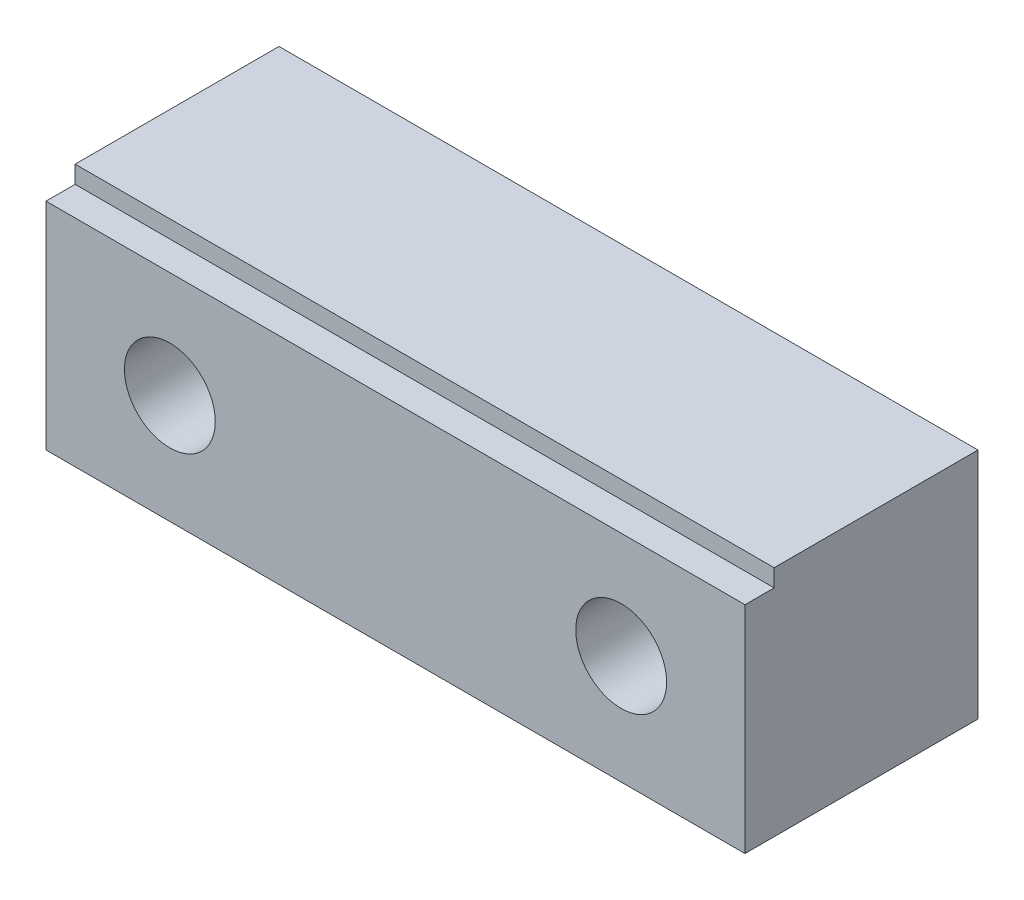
ISO-10303-21;
HEADER;
FILE_DESCRIPTION(('STEP AP214'),'2;1');
FILE_NAME('part.step','',(''),(''),'','','');
FILE_SCHEMA(('AUTOMOTIVE_DESIGN { 1 0 10303 214 1 1 1 1 }'));
ENDSEC;
DATA;
#1=APPLICATION_CONTEXT('core data for automotive mechanical design processes');
#2=APPLICATION_PROTOCOL_DEFINITION('international standard','automotive_design',2000,#1);
#3=PRODUCT_CONTEXT('',#1,'mechanical');
#4=PRODUCT('Part','Part','',(#3));
#5=PRODUCT_RELATED_PRODUCT_CATEGORY('part','',(#4));
#6=PRODUCT_DEFINITION_FORMATION('','',#4);
#7=PRODUCT_DEFINITION_CONTEXT('part definition',#1,'design');
#8=PRODUCT_DEFINITION('design','',#6,#7);
#9=PRODUCT_DEFINITION_SHAPE('','',#8);
#10=(LENGTH_UNIT() NAMED_UNIT(*) SI_UNIT(.MILLI.,.METRE.));
#11=(NAMED_UNIT(*) PLANE_ANGLE_UNIT() SI_UNIT($,.RADIAN.));
#12=(NAMED_UNIT(*) SI_UNIT($,.STERADIAN.) SOLID_ANGLE_UNIT());
#13=UNCERTAINTY_MEASURE_WITH_UNIT(LENGTH_MEASURE(1.E-05),#10,'distance_accuracy_value','');
#14=(GEOMETRIC_REPRESENTATION_CONTEXT(3) GLOBAL_UNCERTAINTY_ASSIGNED_CONTEXT((#13)) GLOBAL_UNIT_ASSIGNED_CONTEXT((#10,
#11,#12)) REPRESENTATION_CONTEXT('',''));
#15=CARTESIAN_POINT('',(0.,0.,0.));
#16=DIRECTION('',(0.,0.,1.));
#17=DIRECTION('',(1.,0.,0.));
#18=AXIS2_PLACEMENT_3D('',#15,#16,#17);
#19=CARTESIAN_POINT('',(76.2,-50.8,-25.4));
#20=DIRECTION('',(1.,0.,0.));
#21=DIRECTION('',(0.,0.,-1.));
#22=AXIS2_PLACEMENT_3D('',#19,#20,#21);
#23=PLANE('',#22);
#24=DIRECTION('',(0.,0.,1.));
#25=VECTOR('',#24,1.);
#26=CARTESIAN_POINT('',(76.2,-3.81,25.3999999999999));
#27=LINE('',#26,#25);
#28=CARTESIAN_POINT('',(76.2,-3.81,19.0499999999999));
#29=VERTEX_POINT('',#28);
#30=CARTESIAN_POINT('',(76.2,-3.81,25.3999999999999));
#31=VERTEX_POINT('',#30);
#32=EDGE_CURVE('E110',#29,#31,#27,.T.);
#33=ORIENTED_EDGE('',*,*,#32,.T.);
#34=DIRECTION('',(0.,1.,0.));
#35=VECTOR('',#34,1.);
#36=CARTESIAN_POINT('',(76.2,-50.8,25.4));
#37=LINE('',#36,#35);
#38=CARTESIAN_POINT('',(76.2,-50.8,25.4));
#39=VERTEX_POINT('',#38);
#40=EDGE_CURVE('E12',#39,#31,#37,.T.);
#41=ORIENTED_EDGE('',*,*,#40,.F.);
#42=DIRECTION('',(0.,0.,-1.));
#43=VECTOR('',#42,1.);
#44=CARTESIAN_POINT('',(76.2,-50.8,-25.4));
#45=LINE('',#44,#43);
#46=CARTESIAN_POINT('',(76.2,-50.8,-25.4));
#47=VERTEX_POINT('',#46);
#48=EDGE_CURVE('E142',#39,#47,#45,.T.);
#49=ORIENTED_EDGE('',*,*,#48,.T.);
#50=DIRECTION('',(0.,1.,0.));
#51=VECTOR('',#50,1.);
#52=CARTESIAN_POINT('',(76.2,-50.8,-25.4));
#53=LINE('',#52,#51);
#54=CARTESIAN_POINT('',(76.2,0.,-25.4));
#55=VERTEX_POINT('',#54);
#56=EDGE_CURVE('E85',#47,#55,#53,.T.);
#57=ORIENTED_EDGE('',*,*,#56,.T.);
#58=DIRECTION('',(0.,0.,-1.));
#59=VECTOR('',#58,1.);
#60=CARTESIAN_POINT('',(76.2,0.,-25.4));
#61=LINE('',#60,#59);
#62=CARTESIAN_POINT('',(76.2,0.,19.0499999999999));
#63=VERTEX_POINT('',#62);
#64=EDGE_CURVE('E115',#63,#55,#61,.T.);
#65=ORIENTED_EDGE('',*,*,#64,.F.);
#66=DIRECTION('',(0.,-1.,0.));
#67=VECTOR('',#66,1.);
#68=CARTESIAN_POINT('',(76.2,0.,19.0499999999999));
#69=LINE('',#68,#67);
#70=EDGE_CURVE('E56',#63,#29,#69,.T.);
#71=ORIENTED_EDGE('',*,*,#70,.T.);
#72=EDGE_LOOP('',(#33,#41,#49,#57,#65,#71));
#73=FACE_BOUND('',#72,.T.);
#74=ADVANCED_FACE('F40',(#73),#23,.T.);
#75=CARTESIAN_POINT('',(-76.2,-50.8,25.4));
#76=DIRECTION('',(0.,0.,1.));
#77=DIRECTION('',(1.,0.,0.));
#78=AXIS2_PLACEMENT_3D('',#75,#76,#77);
#79=PLANE('',#78);
#80=DIRECTION('',(-1.,0.,0.));
#81=VECTOR('',#80,1.);
#82=CARTESIAN_POINT('',(76.2,-3.81,25.3999999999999));
#83=LINE('',#82,#81);
#84=CARTESIAN_POINT('',(-76.2,-3.81,25.4));
#85=VERTEX_POINT('',#84);
#86=EDGE_CURVE('E107',#31,#85,#83,.T.);
#87=ORIENTED_EDGE('',*,*,#86,.T.);
#88=DIRECTION('',(0.,1.,0.));
#89=VECTOR('',#88,1.);
#90=CARTESIAN_POINT('',(-76.2,-50.8,25.4));
#91=LINE('',#90,#89);
#92=CARTESIAN_POINT('',(-76.2,-50.8,25.4));
#93=VERTEX_POINT('',#92);
#94=EDGE_CURVE('E48',#93,#85,#91,.T.);
#95=ORIENTED_EDGE('',*,*,#94,.F.);
#96=DIRECTION('',(1.,0.,0.));
#97=VECTOR('',#96,1.);
#98=CARTESIAN_POINT('',(-76.2,-50.8,25.4));
#99=LINE('',#98,#97);
#100=EDGE_CURVE('E150',#93,#39,#99,.T.);
#101=ORIENTED_EDGE('',*,*,#100,.T.);
#102=ORIENTED_EDGE('',*,*,#40,.T.);
#103=EDGE_LOOP('',(#87,#95,#101,#102));
#104=FACE_BOUND('',#103,.T.);
#105=CARTESIAN_POINT('',(-49.1998,-27.0002,25.4));
#106=DIRECTION('',(0.,0.,1.));
#107=DIRECTION('',(1.,0.,0.));
#108=AXIS2_PLACEMENT_3D('',#105,#106,#107);
#109=CIRCLE('',#108,9.906);
#110=CARTESIAN_POINT('',(-39.2938,-27.0002,25.4));
#111=VERTEX_POINT('',#110);
#112=EDGE_CURVE('E130',#111,#111,#109,.T.);
#113=ORIENTED_EDGE('',*,*,#112,.F.);
#114=EDGE_LOOP('',(#113));
#115=FACE_BOUND('',#114,.T.);
#116=CARTESIAN_POINT('',(49.1998,-27.0002,25.4));
#117=DIRECTION('',(0.,0.,1.));
#118=DIRECTION('',(-1.,0.,0.));
#119=AXIS2_PLACEMENT_3D('',#116,#117,#118);
#120=CIRCLE('',#119,9.906);
#121=CARTESIAN_POINT('',(59.1058,-27.0002,25.4));
#122=VERTEX_POINT('',#121);
#123=EDGE_CURVE('E137',#122,#122,#120,.T.);
#124=ORIENTED_EDGE('',*,*,#123,.F.);
#125=EDGE_LOOP('',(#124));
#126=FACE_BOUND('',#125,.T.);
#127=ADVANCED_FACE('F188',(#104,#115,#126),#79,.T.);
#128=CARTESIAN_POINT('',(-76.2,-50.8,-25.4));
#129=DIRECTION('',(-1.,0.,0.));
#130=DIRECTION('',(0.,0.,1.));
#131=AXIS2_PLACEMENT_3D('',#128,#129,#130);
#132=PLANE('',#131);
#133=DIRECTION('',(0.,0.,1.));
#134=VECTOR('',#133,1.);
#135=CARTESIAN_POINT('',(-76.2,-3.81,25.4));
#136=LINE('',#135,#134);
#137=CARTESIAN_POINT('',(-76.2,-3.81,19.05));
#138=VERTEX_POINT('',#137);
#139=EDGE_CURVE('E116',#138,#85,#136,.T.);
#140=ORIENTED_EDGE('',*,*,#139,.F.);
#141=DIRECTION('',(0.,-1.,0.));
#142=VECTOR('',#141,1.);
#143=CARTESIAN_POINT('',(-76.2,0.,19.05));
#144=LINE('',#143,#142);
#145=CARTESIAN_POINT('',(-76.2,0.,19.05));
#146=VERTEX_POINT('',#145);
#147=EDGE_CURVE('E104',#146,#138,#144,.T.);
#148=ORIENTED_EDGE('',*,*,#147,.F.);
#149=DIRECTION('',(0.,0.,1.));
#150=VECTOR('',#149,1.);
#151=CARTESIAN_POINT('',(-76.2,0.,-25.4));
#152=LINE('',#151,#150);
#153=CARTESIAN_POINT('',(-76.2,0.,-25.4));
#154=VERTEX_POINT('',#153);
#155=EDGE_CURVE('E145',#154,#146,#152,.T.);
#156=ORIENTED_EDGE('',*,*,#155,.F.);
#157=DIRECTION('',(0.,1.,0.));
#158=VECTOR('',#157,1.);
#159=CARTESIAN_POINT('',(-76.2,-50.8,-25.4));
#160=LINE('',#159,#158);
#161=CARTESIAN_POINT('',(-76.2,-50.8,-25.4));
#162=VERTEX_POINT('',#161);
#163=EDGE_CURVE('E80',#162,#154,#160,.T.);
#164=ORIENTED_EDGE('',*,*,#163,.F.);
#165=DIRECTION('',(0.,0.,1.));
#166=VECTOR('',#165,1.);
#167=CARTESIAN_POINT('',(-76.2,-50.8,-25.4));
#168=LINE('',#167,#166);
#169=EDGE_CURVE('E147',#162,#93,#168,.T.);
#170=ORIENTED_EDGE('',*,*,#169,.T.);
#171=ORIENTED_EDGE('',*,*,#94,.T.);
#172=EDGE_LOOP('',(#140,#148,#156,#164,#170,#171));
#173=FACE_BOUND('',#172,.T.);
#174=ADVANCED_FACE('F192',(#173),#132,.T.);
#175=CARTESIAN_POINT('',(-76.2,-50.8,-25.4));
#176=DIRECTION('',(0.,0.,-1.));
#177=DIRECTION('',(-1.,0.,0.));
#178=AXIS2_PLACEMENT_3D('',#175,#176,#177);
#179=PLANE('',#178);
#180=CARTESIAN_POINT('',(-49.1998,-27.0002,-25.4));
#181=DIRECTION('',(0.,0.,1.));
#182=DIRECTION('',(1.,0.,0.));
#183=AXIS2_PLACEMENT_3D('',#180,#181,#182);
#184=CIRCLE('',#183,6.7437);
#185=CARTESIAN_POINT('',(-42.4561,-27.0002,-25.4));
#186=VERTEX_POINT('',#185);
#187=EDGE_CURVE('E124',#186,#186,#184,.T.);
#188=ORIENTED_EDGE('',*,*,#187,.T.);
#189=EDGE_LOOP('',(#188));
#190=FACE_BOUND('',#189,.T.);
#191=CARTESIAN_POINT('',(49.1998,-27.0002,-25.4));
#192=DIRECTION('',(0.,0.,1.));
#193=DIRECTION('',(1.,0.,0.));
#194=AXIS2_PLACEMENT_3D('',#191,#192,#193);
#195=CIRCLE('',#194,6.7437);
#196=CARTESIAN_POINT('',(55.9435,-27.0002,-25.4));
#197=VERTEX_POINT('',#196);
#198=EDGE_CURVE('E121',#197,#197,#195,.T.);
#199=ORIENTED_EDGE('',*,*,#198,.T.);
#200=EDGE_LOOP('',(#199));
#201=FACE_BOUND('',#200,.T.);
#202=DIRECTION('',(-1.,0.,0.));
#203=VECTOR('',#202,1.);
#204=CARTESIAN_POINT('',(-76.2,0.,-25.4));
#205=LINE('',#204,#203);
#206=EDGE_CURVE('E154',#55,#154,#205,.T.);
#207=ORIENTED_EDGE('',*,*,#206,.F.);
#208=ORIENTED_EDGE('',*,*,#56,.F.);
#209=DIRECTION('',(-1.,0.,0.));
#210=VECTOR('',#209,1.);
#211=CARTESIAN_POINT('',(-76.2,-50.8,-25.4));
#212=LINE('',#211,#210);
#213=EDGE_CURVE('E144',#47,#162,#212,.T.);
#214=ORIENTED_EDGE('',*,*,#213,.T.);
#215=ORIENTED_EDGE('',*,*,#163,.T.);
#216=EDGE_LOOP('',(#207,#208,#214,#215));
#217=FACE_BOUND('',#216,.T.);
#218=ADVANCED_FACE('F198',(#190,#201,#217),#179,.T.);
#219=CARTESIAN_POINT('',(0.,-50.8,0.));
#220=DIRECTION('',(0.,1.,0.));
#221=DIRECTION('',(0.,0.,1.));
#222=AXIS2_PLACEMENT_3D('',#219,#220,#221);
#223=PLANE('',#222);
#224=ORIENTED_EDGE('',*,*,#48,.F.);
#225=ORIENTED_EDGE('',*,*,#100,.F.);
#226=ORIENTED_EDGE('',*,*,#169,.F.);
#227=ORIENTED_EDGE('',*,*,#213,.F.);
#228=EDGE_LOOP('',(#224,#225,#226,#227));
#229=FACE_BOUND('',#228,.T.);
#230=ADVANCED_FACE('F206',(#229),#223,.F.);
#231=CARTESIAN_POINT('',(0.,0.,0.));
#232=DIRECTION('',(0.,1.,0.));
#233=DIRECTION('',(0.,0.,1.));
#234=AXIS2_PLACEMENT_3D('',#231,#232,#233);
#235=PLANE('',#234);
#236=DIRECTION('',(-1.,0.,0.));
#237=VECTOR('',#236,1.);
#238=CARTESIAN_POINT('',(76.2,0.,19.0499999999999));
#239=LINE('',#238,#237);
#240=EDGE_CURVE('E108',#63,#146,#239,.T.);
#241=ORIENTED_EDGE('',*,*,#240,.F.);
#242=ORIENTED_EDGE('',*,*,#64,.T.);
#243=ORIENTED_EDGE('',*,*,#206,.T.);
#244=ORIENTED_EDGE('',*,*,#155,.T.);
#245=EDGE_LOOP('',(#241,#242,#243,#244));
#246=FACE_BOUND('',#245,.T.);
#247=ADVANCED_FACE('F203',(#246),#235,.T.);
#248=CARTESIAN_POINT('',(-76.2,-50.8,-16.002));
#249=DIRECTION('',(0.,0.,-1.));
#250=DIRECTION('',(-1.,0.,0.));
#251=AXIS2_PLACEMENT_3D('',#248,#249,#250);
#252=PLANE('',#251);
#253=CARTESIAN_POINT('',(49.1998,-27.0002,-16.002));
#254=DIRECTION('',(0.,0.,-1.));
#255=DIRECTION('',(-1.,0.,0.));
#256=AXIS2_PLACEMENT_3D('',#253,#254,#255);
#257=CIRCLE('',#256,6.7437);
#258=CARTESIAN_POINT('',(42.4561,-27.0002,-16.002));
#259=VERTEX_POINT('',#258);
#260=EDGE_CURVE('E43',#259,#259,#257,.T.);
#261=ORIENTED_EDGE('',*,*,#260,.T.);
#262=EDGE_LOOP('',(#261));
#263=FACE_BOUND('',#262,.T.);
#264=CARTESIAN_POINT('',(49.1998,-27.0002,-16.002));
#265=DIRECTION('',(0.,0.,-1.));
#266=DIRECTION('',(-1.,0.,0.));
#267=AXIS2_PLACEMENT_3D('',#264,#265,#266);
#268=CIRCLE('',#267,9.906);
#269=CARTESIAN_POINT('',(59.1058,-27.0002,-16.002));
#270=VERTEX_POINT('',#269);
#271=EDGE_CURVE('E134',#270,#270,#268,.F.);
#272=ORIENTED_EDGE('',*,*,#271,.T.);
#273=EDGE_LOOP('',(#272));
#274=FACE_BOUND('',#273,.T.);
#275=ADVANCED_FACE('F169',(#263,#274),#252,.F.);
#276=CARTESIAN_POINT('',(49.1998,-27.0002,-53.4183990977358));
#277=DIRECTION('',(0.,0.,1.));
#278=DIRECTION('',(1.,0.,0.));
#279=AXIS2_PLACEMENT_3D('',#276,#277,#278);
#280=CYLINDRICAL_SURFACE('',#279,9.906);
#281=CARTESIAN_POINT('',(59.1058,-27.0002,25.4));
#282=CARTESIAN_POINT('',(59.1058,-27.0002,24.9687291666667));
#283=CARTESIAN_POINT('',(59.1058,-27.0002,24.5374583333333));
#284=CARTESIAN_POINT('',(59.1058,-27.0002,23.6749166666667));
#285=CARTESIAN_POINT('',(59.1058,-27.0002,23.2436458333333));
#286=CARTESIAN_POINT('',(59.1058,-27.0002,22.3811041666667));
#287=CARTESIAN_POINT('',(59.1058,-27.0002,21.9498333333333));
#288=CARTESIAN_POINT('',(59.1058,-27.0002,21.0872916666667));
#289=CARTESIAN_POINT('',(59.1058,-27.0002,20.6560208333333));
#290=CARTESIAN_POINT('',(59.1058,-27.0002,19.7934791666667));
#291=CARTESIAN_POINT('',(59.1058,-27.0002,19.3622083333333));
#292=CARTESIAN_POINT('',(59.1058,-27.0002,18.4996666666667));
#293=CARTESIAN_POINT('',(59.1058,-27.0002,18.0683958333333));
#294=CARTESIAN_POINT('',(59.1058,-27.0002,17.2058541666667));
#295=CARTESIAN_POINT('',(59.1058,-27.0002,16.7745833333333));
#296=CARTESIAN_POINT('',(59.1058,-27.0002,15.9120416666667));
#297=CARTESIAN_POINT('',(59.1058,-27.0002,15.4807708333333));
#298=CARTESIAN_POINT('',(59.1058,-27.0002,14.6182291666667));
#299=CARTESIAN_POINT('',(59.1058,-27.0002,14.1869583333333));
#300=CARTESIAN_POINT('',(59.1058,-27.0002,13.3244166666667));
#301=CARTESIAN_POINT('',(59.1058,-27.0002,12.8931458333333));
#302=CARTESIAN_POINT('',(59.1058,-27.0002,12.0306041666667));
#303=CARTESIAN_POINT('',(59.1058,-27.0002,11.5993333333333));
#304=CARTESIAN_POINT('',(59.1058,-27.0002,10.7367916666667));
#305=CARTESIAN_POINT('',(59.1058,-27.0002,10.3055208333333));
#306=CARTESIAN_POINT('',(59.1058,-27.0002,9.44297916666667));
#307=CARTESIAN_POINT('',(59.1058,-27.0002,9.01170833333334));
#308=CARTESIAN_POINT('',(59.1058,-27.0002,8.14916666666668));
#309=CARTESIAN_POINT('',(59.1058,-27.0002,7.71789583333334));
#310=CARTESIAN_POINT('',(59.1058,-27.0002,6.85535416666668));
#311=CARTESIAN_POINT('',(59.1058,-27.0002,6.42408333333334));
#312=CARTESIAN_POINT('',(59.1058,-27.0002,5.56154166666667));
#313=CARTESIAN_POINT('',(59.1058,-27.0002,5.13027083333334));
#314=CARTESIAN_POINT('',(59.1058,-27.0002,4.26772916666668));
#315=CARTESIAN_POINT('',(59.1058,-27.0002,3.83645833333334));
#316=CARTESIAN_POINT('',(59.1058,-27.0002,2.97391666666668));
#317=CARTESIAN_POINT('',(59.1058,-27.0002,2.54264583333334));
#318=CARTESIAN_POINT('',(59.1058,-27.0002,1.68010416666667));
#319=CARTESIAN_POINT('',(59.1058,-27.0002,1.24883333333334));
#320=CARTESIAN_POINT('',(59.1058,-27.0002,0.386291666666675));
#321=CARTESIAN_POINT('',(59.1058,-27.0002,-0.0449791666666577));
#322=CARTESIAN_POINT('',(59.1058,-27.0002,-0.907520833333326));
#323=CARTESIAN_POINT('',(59.1058,-27.0002,-1.33879166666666));
#324=CARTESIAN_POINT('',(59.1058,-27.0002,-2.20133333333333));
#325=CARTESIAN_POINT('',(59.1058,-27.0002,-2.63260416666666));
#326=CARTESIAN_POINT('',(59.1058,-27.0002,-3.49514583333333));
#327=CARTESIAN_POINT('',(59.1058,-27.0002,-3.92641666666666));
#328=CARTESIAN_POINT('',(59.1058,-27.0002,-4.78895833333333));
#329=CARTESIAN_POINT('',(59.1058,-27.0002,-5.22022916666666));
#330=CARTESIAN_POINT('',(59.1058,-27.0002,-6.08277083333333));
#331=CARTESIAN_POINT('',(59.1058,-27.0002,-6.51404166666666));
#332=CARTESIAN_POINT('',(59.1058,-27.0002,-7.37658333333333));
#333=CARTESIAN_POINT('',(59.1058,-27.0002,-7.80785416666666));
#334=CARTESIAN_POINT('',(59.1058,-27.0002,-8.67039583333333));
#335=CARTESIAN_POINT('',(59.1058,-27.0002,-9.10166666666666));
#336=CARTESIAN_POINT('',(59.1058,-27.0002,-9.96420833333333));
#337=CARTESIAN_POINT('',(59.1058,-27.0002,-10.3954791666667));
#338=CARTESIAN_POINT('',(59.1058,-27.0002,-11.2580208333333));
#339=CARTESIAN_POINT('',(59.1058,-27.0002,-11.6892916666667));
#340=CARTESIAN_POINT('',(59.1058,-27.0002,-12.5518333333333));
#341=CARTESIAN_POINT('',(59.1058,-27.0002,-12.9831041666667));
#342=CARTESIAN_POINT('',(59.1058,-27.0002,-13.8456458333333));
#343=CARTESIAN_POINT('',(59.1058,-27.0002,-14.2769166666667));
#344=CARTESIAN_POINT('',(59.1058,-27.0002,-15.1394583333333));
#345=CARTESIAN_POINT('',(59.1058,-27.0002,-15.5707291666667));
#346=CARTESIAN_POINT('',(59.1058,-27.0002,-16.002));
#347=B_SPLINE_CURVE_WITH_KNOTS('',3,(#281,#282,#283,#284,#285,#286,#287,#288,#289,#290,#291,
#292,#293,#294,#295,#296,#297,#298,#299,#300,#301,#302,#303,#304,#305,#306,#307,#308,#309,#310,
#311,#312,#313,#314,#315,#316,#317,#318,#319,#320,#321,#322,#323,#324,#325,#326,#327,#328,#329,
#330,#331,#332,#333,#334,#335,#336,#337,#338,#339,#340,#341,#342,#343,#344,#345,#346),
.UNSPECIFIED.,.F.,.F.,(4,2,2,2,2,2,2,2,2,2,2,2,2,2,2,2,2,2,2,2,2,2,2,2,2,2,2,2,2,2,2,2,4),(0.,
1.2938125,2.587625,3.8814375,5.17525000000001,6.4690625,7.762875,9.05668750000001,10.3505,
11.6443125,12.938125,14.2319375,15.52575,16.8195625,18.113375,19.4071875,20.701,21.9948125,
23.288625,24.5824375,25.87625,27.1700625,28.463875,29.7576875,31.0515,32.3453125,33.639125,
34.9329375,36.22675,37.5205625,38.814375,40.1081875,41.402),.UNSPECIFIED.);
#348=EDGE_CURVE('BSEAM221',#122,#270,#347,.T.);
#349=ORIENTED_EDGE('',*,*,#123,.T.);
#350=ORIENTED_EDGE('',*,*,#271,.F.);
#351=ORIENTED_EDGE('',*,*,#348,.T.);
#352=ORIENTED_EDGE('',*,*,#348,.F.);
#353=EDGE_LOOP('',(#349,#351,#350,#352));
#354=FACE_BOUND('',#353,.T.);
#355=ADVANCED_FACE('F221',(#354),#280,.F.);
#356=CARTESIAN_POINT('',(-76.2,-50.8,-16.002));
#357=DIRECTION('',(0.,0.,-1.));
#358=DIRECTION('',(-1.,0.,0.));
#359=AXIS2_PLACEMENT_3D('',#356,#357,#358);
#360=PLANE('',#359);
#361=CARTESIAN_POINT('',(-49.1998,-27.0002,-16.002));
#362=DIRECTION('',(0.,0.,-1.));
#363=DIRECTION('',(-1.,0.,0.));
#364=AXIS2_PLACEMENT_3D('',#361,#362,#363);
#365=CIRCLE('',#364,6.7437);
#366=CARTESIAN_POINT('',(-55.9435,-27.0002,-16.002));
#367=VERTEX_POINT('',#366);
#368=EDGE_CURVE('E127',#367,#367,#365,.T.);
#369=ORIENTED_EDGE('',*,*,#368,.T.);
#370=EDGE_LOOP('',(#369));
#371=FACE_BOUND('',#370,.T.);
#372=CARTESIAN_POINT('',(-49.1998,-27.0002,-16.002));
#373=DIRECTION('',(0.,0.,-1.));
#374=DIRECTION('',(-1.,0.,0.));
#375=AXIS2_PLACEMENT_3D('',#372,#373,#374);
#376=CIRCLE('',#375,9.906);
#377=CARTESIAN_POINT('',(-39.2938,-27.0002,-16.002));
#378=VERTEX_POINT('',#377);
#379=EDGE_CURVE('E133',#378,#378,#376,.F.);
#380=ORIENTED_EDGE('',*,*,#379,.T.);
#381=EDGE_LOOP('',(#380));
#382=FACE_BOUND('',#381,.T.);
#383=ADVANCED_FACE('F226',(#371,#382),#360,.F.);
#384=CARTESIAN_POINT('',(-49.1998,-27.0002,-53.4183990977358));
#385=DIRECTION('',(0.,0.,1.));
#386=DIRECTION('',(1.,0.,0.));
#387=AXIS2_PLACEMENT_3D('',#384,#385,#386);
#388=CYLINDRICAL_SURFACE('',#387,9.906);
#389=CARTESIAN_POINT('',(-39.2938,-27.0002,25.4));
#390=CARTESIAN_POINT('',(-39.2938,-27.0002,24.9687291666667));
#391=CARTESIAN_POINT('',(-39.2938,-27.0002,24.5374583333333));
#392=CARTESIAN_POINT('',(-39.2938,-27.0002,23.6749166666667));
#393=CARTESIAN_POINT('',(-39.2938,-27.0002,23.2436458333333));
#394=CARTESIAN_POINT('',(-39.2938,-27.0002,22.3811041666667));
#395=CARTESIAN_POINT('',(-39.2938,-27.0002,21.9498333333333));
#396=CARTESIAN_POINT('',(-39.2938,-27.0002,21.0872916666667));
#397=CARTESIAN_POINT('',(-39.2938,-27.0002,20.6560208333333));
#398=CARTESIAN_POINT('',(-39.2938,-27.0002,19.7934791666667));
#399=CARTESIAN_POINT('',(-39.2938,-27.0002,19.3622083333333));
#400=CARTESIAN_POINT('',(-39.2938,-27.0002,18.4996666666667));
#401=CARTESIAN_POINT('',(-39.2938,-27.0002,18.0683958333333));
#402=CARTESIAN_POINT('',(-39.2938,-27.0002,17.2058541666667));
#403=CARTESIAN_POINT('',(-39.2938,-27.0002,16.7745833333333));
#404=CARTESIAN_POINT('',(-39.2938,-27.0002,15.9120416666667));
#405=CARTESIAN_POINT('',(-39.2938,-27.0002,15.4807708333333));
#406=CARTESIAN_POINT('',(-39.2938,-27.0002,14.6182291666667));
#407=CARTESIAN_POINT('',(-39.2938,-27.0002,14.1869583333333));
#408=CARTESIAN_POINT('',(-39.2938,-27.0002,13.3244166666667));
#409=CARTESIAN_POINT('',(-39.2938,-27.0002,12.8931458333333));
#410=CARTESIAN_POINT('',(-39.2938,-27.0002,12.0306041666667));
#411=CARTESIAN_POINT('',(-39.2938,-27.0002,11.5993333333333));
#412=CARTESIAN_POINT('',(-39.2938,-27.0002,10.7367916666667));
#413=CARTESIAN_POINT('',(-39.2938,-27.0002,10.3055208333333));
#414=CARTESIAN_POINT('',(-39.2938,-27.0002,9.44297916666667));
#415=CARTESIAN_POINT('',(-39.2938,-27.0002,9.01170833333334));
#416=CARTESIAN_POINT('',(-39.2938,-27.0002,8.14916666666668));
#417=CARTESIAN_POINT('',(-39.2938,-27.0002,7.71789583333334));
#418=CARTESIAN_POINT('',(-39.2938,-27.0002,6.85535416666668));
#419=CARTESIAN_POINT('',(-39.2938,-27.0002,6.42408333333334));
#420=CARTESIAN_POINT('',(-39.2938,-27.0002,5.56154166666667));
#421=CARTESIAN_POINT('',(-39.2938,-27.0002,5.13027083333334));
#422=CARTESIAN_POINT('',(-39.2938,-27.0002,4.26772916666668));
#423=CARTESIAN_POINT('',(-39.2938,-27.0002,3.83645833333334));
#424=CARTESIAN_POINT('',(-39.2938,-27.0002,2.97391666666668));
#425=CARTESIAN_POINT('',(-39.2938,-27.0002,2.54264583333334));
#426=CARTESIAN_POINT('',(-39.2938,-27.0002,1.68010416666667));
#427=CARTESIAN_POINT('',(-39.2938,-27.0002,1.24883333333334));
#428=CARTESIAN_POINT('',(-39.2938,-27.0002,0.386291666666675));
#429=CARTESIAN_POINT('',(-39.2938,-27.0002,-0.0449791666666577));
#430=CARTESIAN_POINT('',(-39.2938,-27.0002,-0.907520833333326));
#431=CARTESIAN_POINT('',(-39.2938,-27.0002,-1.33879166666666));
#432=CARTESIAN_POINT('',(-39.2938,-27.0002,-2.20133333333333));
#433=CARTESIAN_POINT('',(-39.2938,-27.0002,-2.63260416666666));
#434=CARTESIAN_POINT('',(-39.2938,-27.0002,-3.49514583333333));
#435=CARTESIAN_POINT('',(-39.2938,-27.0002,-3.92641666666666));
#436=CARTESIAN_POINT('',(-39.2938,-27.0002,-4.78895833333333));
#437=CARTESIAN_POINT('',(-39.2938,-27.0002,-5.22022916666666));
#438=CARTESIAN_POINT('',(-39.2938,-27.0002,-6.08277083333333));
#439=CARTESIAN_POINT('',(-39.2938,-27.0002,-6.51404166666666));
#440=CARTESIAN_POINT('',(-39.2938,-27.0002,-7.37658333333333));
#441=CARTESIAN_POINT('',(-39.2938,-27.0002,-7.80785416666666));
#442=CARTESIAN_POINT('',(-39.2938,-27.0002,-8.67039583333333));
#443=CARTESIAN_POINT('',(-39.2938,-27.0002,-9.10166666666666));
#444=CARTESIAN_POINT('',(-39.2938,-27.0002,-9.96420833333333));
#445=CARTESIAN_POINT('',(-39.2938,-27.0002,-10.3954791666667));
#446=CARTESIAN_POINT('',(-39.2938,-27.0002,-11.2580208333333));
#447=CARTESIAN_POINT('',(-39.2938,-27.0002,-11.6892916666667));
#448=CARTESIAN_POINT('',(-39.2938,-27.0002,-12.5518333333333));
#449=CARTESIAN_POINT('',(-39.2938,-27.0002,-12.9831041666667));
#450=CARTESIAN_POINT('',(-39.2938,-27.0002,-13.8456458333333));
#451=CARTESIAN_POINT('',(-39.2938,-27.0002,-14.2769166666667));
#452=CARTESIAN_POINT('',(-39.2938,-27.0002,-15.1394583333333));
#453=CARTESIAN_POINT('',(-39.2938,-27.0002,-15.5707291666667));
#454=CARTESIAN_POINT('',(-39.2938,-27.0002,-16.002));
#455=B_SPLINE_CURVE_WITH_KNOTS('',3,(#389,#390,#391,#392,#393,#394,#395,#396,#397,#398,#399,
#400,#401,#402,#403,#404,#405,#406,#407,#408,#409,#410,#411,#412,#413,#414,#415,#416,#417,#418,
#419,#420,#421,#422,#423,#424,#425,#426,#427,#428,#429,#430,#431,#432,#433,#434,#435,#436,#437,
#438,#439,#440,#441,#442,#443,#444,#445,#446,#447,#448,#449,#450,#451,#452,#453,#454),
.UNSPECIFIED.,.F.,.F.,(4,2,2,2,2,2,2,2,2,2,2,2,2,2,2,2,2,2,2,2,2,2,2,2,2,2,2,2,2,2,2,2,4),(0.,
1.2938125,2.587625,3.8814375,5.17525000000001,6.4690625,7.762875,9.05668750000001,10.3505,
11.6443125,12.938125,14.2319375,15.52575,16.8195625,18.113375,19.4071875,20.701,21.9948125,
23.288625,24.5824375,25.87625,27.1700625,28.463875,29.7576875,31.0515,32.3453125,33.639125,
34.9329375,36.22675,37.5205625,38.814375,40.1081875,41.402),.UNSPECIFIED.);
#456=EDGE_CURVE('BSEAM182',#111,#378,#455,.T.);
#457=ORIENTED_EDGE('',*,*,#112,.T.);
#458=ORIENTED_EDGE('',*,*,#379,.F.);
#459=ORIENTED_EDGE('',*,*,#456,.T.);
#460=ORIENTED_EDGE('',*,*,#456,.F.);
#461=EDGE_LOOP('',(#457,#459,#458,#460));
#462=FACE_BOUND('',#461,.T.);
#463=ADVANCED_FACE('F182',(#462),#388,.F.);
#464=CARTESIAN_POINT('',(-49.1998,-27.0002,-25.4));
#465=DIRECTION('',(0.,0.,1.));
#466=DIRECTION('',(1.,0.,0.));
#467=AXIS2_PLACEMENT_3D('',#464,#465,#466);
#468=CYLINDRICAL_SURFACE('',#467,6.7437);
#469=ORIENTED_EDGE('',*,*,#187,.F.);
#470=EDGE_LOOP('',(#469));
#471=FACE_BOUND('',#470,.T.);
#472=ORIENTED_EDGE('',*,*,#368,.F.);
#473=EDGE_LOOP('',(#472));
#474=FACE_BOUND('',#473,.T.);
#475=ADVANCED_FACE('F174',(#471,#474),#468,.F.);
#476=CARTESIAN_POINT('',(49.1998,-27.0002,-25.4));
#477=DIRECTION('',(0.,0.,1.));
#478=DIRECTION('',(1.,0.,0.));
#479=AXIS2_PLACEMENT_3D('',#476,#477,#478);
#480=CYLINDRICAL_SURFACE('',#479,6.7437);
#481=ORIENTED_EDGE('',*,*,#198,.F.);
#482=EDGE_LOOP('',(#481));
#483=FACE_BOUND('',#482,.T.);
#484=ORIENTED_EDGE('',*,*,#260,.F.);
#485=EDGE_LOOP('',(#484));
#486=FACE_BOUND('',#485,.T.);
#487=ADVANCED_FACE('F172',(#483,#486),#480,.F.);
#488=CARTESIAN_POINT('',(76.2,-3.81,25.3999999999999));
#489=DIRECTION('',(0.,-1.,0.));
#490=DIRECTION('',(0.,0.,-1.));
#491=AXIS2_PLACEMENT_3D('',#488,#489,#490);
#492=PLANE('',#491);
#493=ORIENTED_EDGE('',*,*,#139,.T.);
#494=ORIENTED_EDGE('',*,*,#86,.F.);
#495=ORIENTED_EDGE('',*,*,#32,.F.);
#496=DIRECTION('',(-1.,0.,0.));
#497=VECTOR('',#496,1.);
#498=CARTESIAN_POINT('',(76.2,-3.81,19.0499999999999));
#499=LINE('',#498,#497);
#500=EDGE_CURVE('E100',#29,#138,#499,.T.);
#501=ORIENTED_EDGE('',*,*,#500,.T.);
#502=EDGE_LOOP('',(#493,#494,#495,#501));
#503=FACE_BOUND('',#502,.T.);
#504=ADVANCED_FACE('F111',(#503),#492,.F.);
#505=CARTESIAN_POINT('',(76.2,0.,19.0499999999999));
#506=DIRECTION('',(0.,0.,-1.));
#507=DIRECTION('',(-1.,0.,0.));
#508=AXIS2_PLACEMENT_3D('',#505,#506,#507);
#509=PLANE('',#508);
#510=ORIENTED_EDGE('',*,*,#147,.T.);
#511=ORIENTED_EDGE('',*,*,#500,.F.);
#512=ORIENTED_EDGE('',*,*,#70,.F.);
#513=ORIENTED_EDGE('',*,*,#240,.T.);
#514=EDGE_LOOP('',(#510,#511,#512,#513));
#515=FACE_BOUND('',#514,.T.);
#516=ADVANCED_FACE('F102',(#515),#509,.F.);
#517=CLOSED_SHELL('',(#74,#127,#174,#218,#230,#247,#275,#355,#383,#463,#475,#487,#504,#516));
#518=MANIFOLD_SOLID_BREP('B2',#517);
#519=ADVANCED_BREP_SHAPE_REPRESENTATION('',(#18,#518),#14);
#520=SHAPE_DEFINITION_REPRESENTATION(#9,#519);
ENDSEC;
END-ISO-10303-21;
